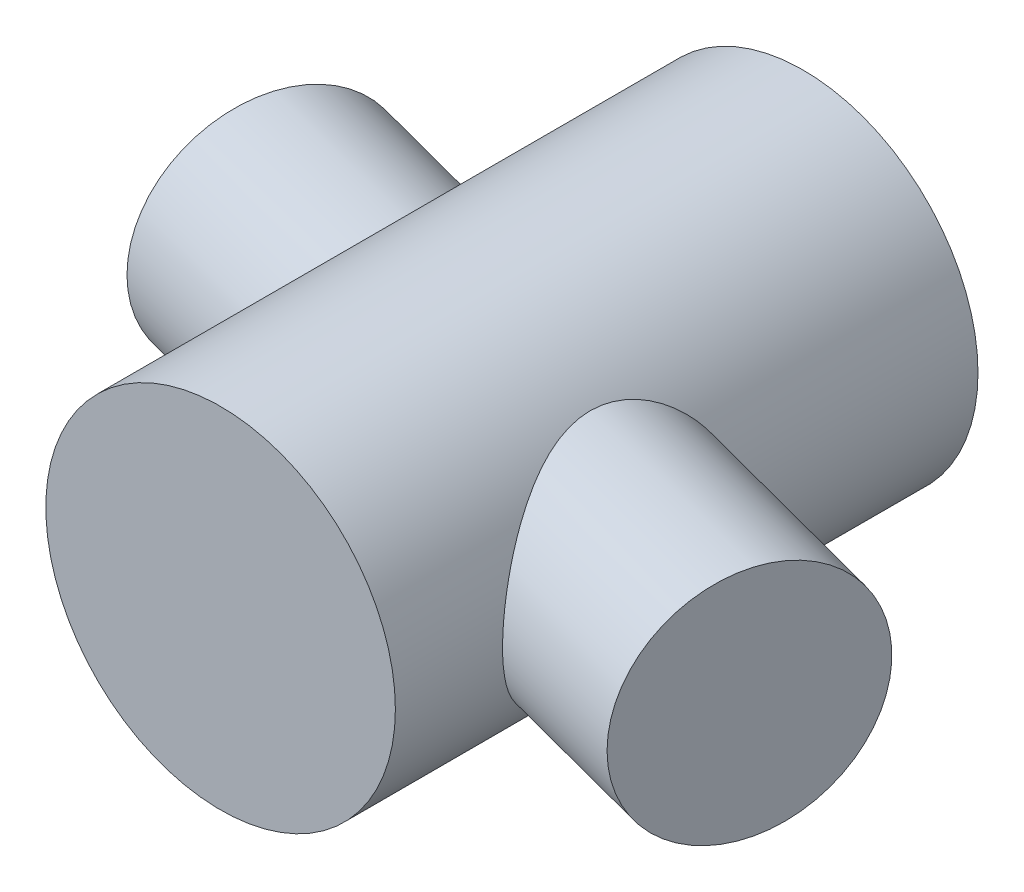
from build123d import *

# Parameters (mm, degrees)
SKETCH_1_R      = 15
EXTRUDE_1_DEPTH = 50


with BuildPart() as part:
    # Sketch 1 → Extrude 1 (new body)
    with BuildSketch(Plane.XY):
        Circle(SKETCH_1_R)
    extrude(amount=EXTRUDE_1_DEPTH)

    # Sketch 2 → Revolve 1 (revolve)
    with BuildSketch(Plane(origin=(0, 0, 0), x_dir=(1, 0, 0), z_dir=(0, 1, 0))):
        Polygon((27.181180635, -44.015763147), (-28.790627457, -29.243210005), (-26.238727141, -19.574300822), (29.73308095, -34.346853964), align=None)
    revolve(axis=Axis((-26.238727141, 0, 19.574300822), (0.9668909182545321, 0, 0.25519003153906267)))


solid = part.part
